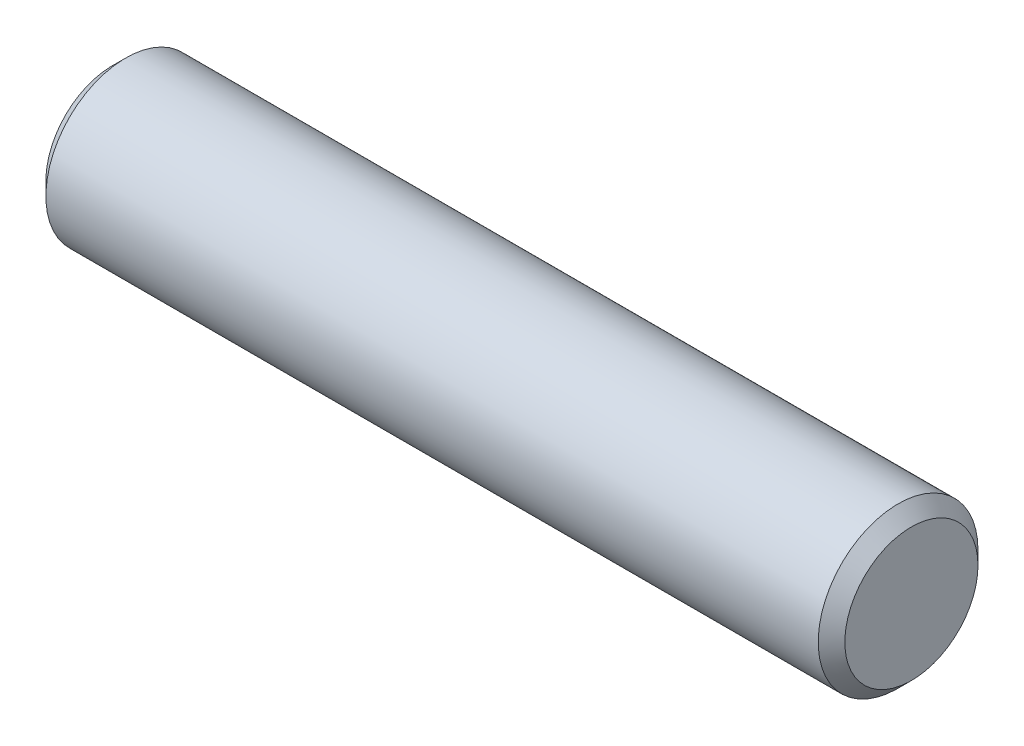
from build123d import *

# Parameters (mm, degrees)
ESQUISSE1_R          = 3
BASE_EXTRUSION_DEPTH = 30
CHANFREIN_0_5_SIZE   = 0.5


with BuildPart() as part:
    # Esquisse1 → Base-Extrusion (new body)
    with BuildSketch(Plane(origin=(0, 0, 0), x_dir=(0, 0, -1), z_dir=(1, 0, 0))):
        Circle(ESQUISSE1_R)
    extrude(amount=-BASE_EXTRUSION_DEPTH)

    # Chanfrein-0_5
    chanfrein_0_5_edges = [part.edges().sort_by_distance(p)[0] for p in [
        (0, 0, 3),
        (-30, 0, 3),
    ]]
    chamfer(chanfrein_0_5_edges, length=CHANFREIN_0_5_SIZE)


solid = part.part
